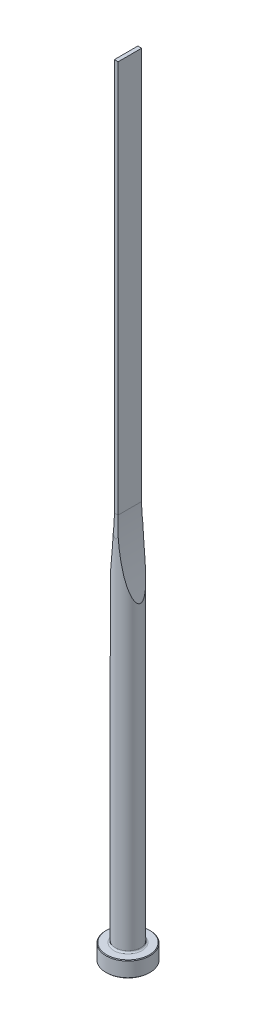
from build123d import *

# Parameters (mm, degrees)
CUT_EXTRUDE1_DEPTH = 5
CUT_EXTRUDE2_DEPTH = 5


with BuildPart() as part:
    # Sketch1 → Revolve1 (revolve)
    with BuildSketch(Plane.XY, mode=Mode.PRIVATE) as revolve1_sk:
        with BuildLine():
            Line((0, 0), (6.8, 0))
            Line((6.8, 0), (7, 0.2))
            Line((7, 0.2), (7, 4.8))
            Line((7, 4.8), (6.8, 5))
            Line((6.8, 5), (4.5, 5))
            ThreePointArc((4.5, 5), (4.146446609, 5.146446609), (4, 5.5))
            Line((4, 5.5), (4, 250))
            Line((4, 250), (0, 250))
            Line((0, 250), (0, 0))
        make_face()
    revolve(revolve1_sk.sketch.rotate(Axis((0, 250, 0), (0, -1, 0)), 180), axis=Axis((0, 250, 0), (0, -1, 0)))

    # Sketch2 → Cut-Extrude1 (cut, symmetric)
    with BuildSketch(Plane.XY):
        with BuildLine():
            Line((0.6, 250), (0.6, 125))
            ThreePointArc((0.6, 125), (1.454052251, 112.630683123), (4, 100.496122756))
            Line((4, 100.496122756), (4, 250))
            Line((4, 250), (0.6, 250))
        make_face()
        with BuildLine():
            Line((-0.6, 250), (-0.6, 125))
            ThreePointArc((-0.6, 125), (-1.454052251, 112.630683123), (-4, 100.496122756))
            Line((-4, 100.496122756), (-4, 250))
            Line((-4, 250), (-0.6, 250))
        make_face()
    extrude(amount=CUT_EXTRUDE1_DEPTH, both=True, mode=Mode.SUBTRACT)

    # Sketch3 → Cut-Extrude2 (cut, symmetric)
    with BuildSketch(Plane(origin=(0, 0, 0), x_dir=(0, 0, -1), z_dir=(1, 0, 0))):
        with BuildLine():
            Line((3.75, 250), (3.75, 125))
            ThreePointArc((3.75, 125), (3.812521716, 121.645898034), (4, 118.296456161))
            Line((4, 118.296456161), (4, 250))
            Line((4, 250), (3.75, 250))
        make_face()
        with BuildLine():
            Line((-3.75, 250), (-3.75, 125))
            ThreePointArc((-3.75, 125), (-3.812521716, 121.645898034), (-4, 118.296456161))
            Line((-4, 118.296456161), (-4, 250))
            Line((-4, 250), (-3.75, 250))
        make_face()
    extrude(amount=CUT_EXTRUDE2_DEPTH, both=True, mode=Mode.SUBTRACT)


solid = part.part
